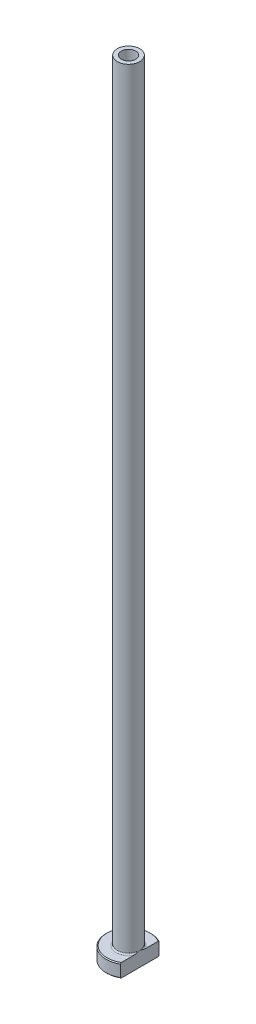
from build123d import *

# Parameters (mm, degrees)
FILLET1_R          = 0.3
CHAMFER1_SIZE      = 0.2
CUT_EXTRUDE1_DEPTH = 176.142798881
CHAMFER2_SIZE      = 0.5


with BuildPart() as part:
    # Sketch1 → Revolve1 (revolve)
    with BuildSketch(Plane.XY, mode=Mode.PRIVATE) as revolve1_sk:
        Polygon((-1.6, 175), (-2.5, 175), (-2.5, 3), (-5, 3), (-5, 0), (-1.85, 0), (-1.85, 118), (-1.6, 130), align=None)
    revolve(revolve1_sk.sketch.rotate(Axis((0, 92.187680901, 0), (0, -1, 0)), 270), axis=Axis((0, 92.187680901, 0), (0, -1, 0)))

    # Fillet1
    fillet1_edges = [part.edges().sort_by_distance(p)[0] for p in [
        (0, 3, -2.5),
    ]]
    fillet(fillet1_edges, radius=FILLET1_R)

    # Chamfer1
    chamfer1_edges = [part.edges().sort_by_distance(p)[0] for p in [
        (0, 0, -5),
        (0, 3, -5),
    ]]
    chamfer(chamfer1_edges, length=CHAMFER1_SIZE)

    # Sketch2 → Cut-Extrude1 (cut, through all)
    with BuildSketch(Plane.XZ):
        with BuildLine():
            Line((2.5, 4.330127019), (2.5, -4.330127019))
            ThreePointArc((2.5, -4.330127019), (5, 0), (2.5, 4.330127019))
        make_face()
    extrude(amount=-CUT_EXTRUDE1_DEPTH, mode=Mode.SUBTRACT)

    # Chamfer2
    chamfer2_edges = [part.edges().sort_by_distance(p)[0] for p in [
        (0, 0, -1.85),
    ]]
    chamfer(chamfer2_edges, length=CHAMFER2_SIZE)


solid = part.part
